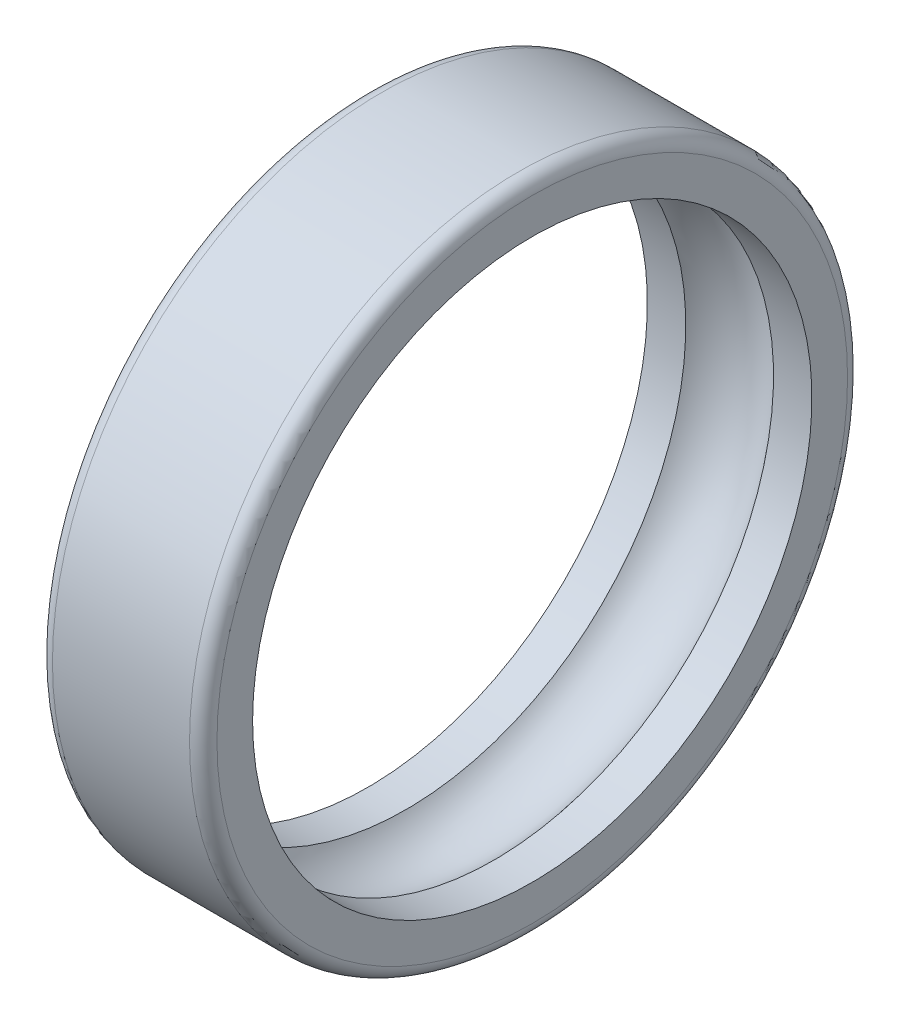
from build123d import *


with BuildPart() as part:
    # Esquisse1 → Base-R_volution (revolve)
    with BuildSketch(Plane.XY, mode=Mode.PRIVATE) as base_r_volution_sk:
        with BuildLine():
            Line((1.6, 10.2), (3, 10.2))
            Line((3, 10.2), (3, 11.5))
            ThreePointArc((3, 11.5), (2.853553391, 11.853553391), (2.5, 12))
            Line((2.5, 12), (-2.5, 12))
            ThreePointArc((-2.5, 12), (-2.853553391, 11.853553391), (-3, 11.5))
            Line((-3, 11.5), (-3, 10.2))
            Line((-3, 10.2), (-1.6, 10.2))
            ThreePointArc((-1.6, 10.2), (0, 11), (1.6, 10.2))
        make_face()
    revolve(base_r_volution_sk.sketch.rotate(Axis((-4.370908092, 0, 0), (1, 0, 0)), 90), axis=Axis((-4.370908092, 0, 0), (1, 0, 0)))


solid = part.part
